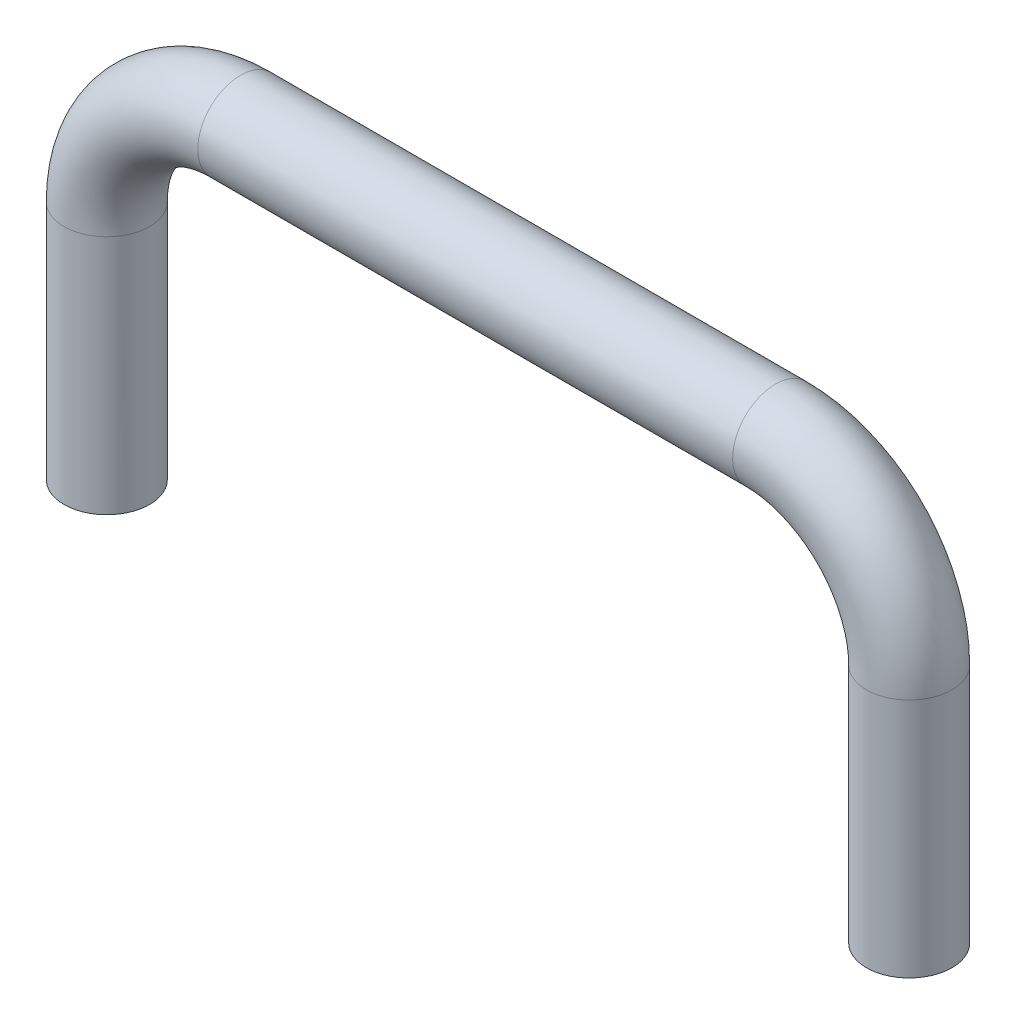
from build123d import *

# Parameters (mm, degrees)
ESQUISSE2_R = 8


with BuildPart() as part:
    # Balayage1: sweep along a path in Esquisse1
    with BuildLine(Plane.XY) as balayage1_path:
        Line((-75, 0), (-75, 45))
        ThreePointArc((-75, 45), (-67.67766953, 62.67766953), (-50, 70))
        Line((-50, 70), (50, 70))
        ThreePointArc((50, 70), (67.67766953, 62.67766953), (75, 45))
        Line((75, 45), (75, 0))
    # Esquisse2 → Balayage1 (sweep)
    with BuildSketch(Plane(origin=(0, 0, 0), x_dir=(1, 0, 0), z_dir=(0, 1, 0))):
        with Locations((-75, 0)):
            Circle(ESQUISSE2_R)
    sweep(path=balayage1_path.line)


solid = part.part
